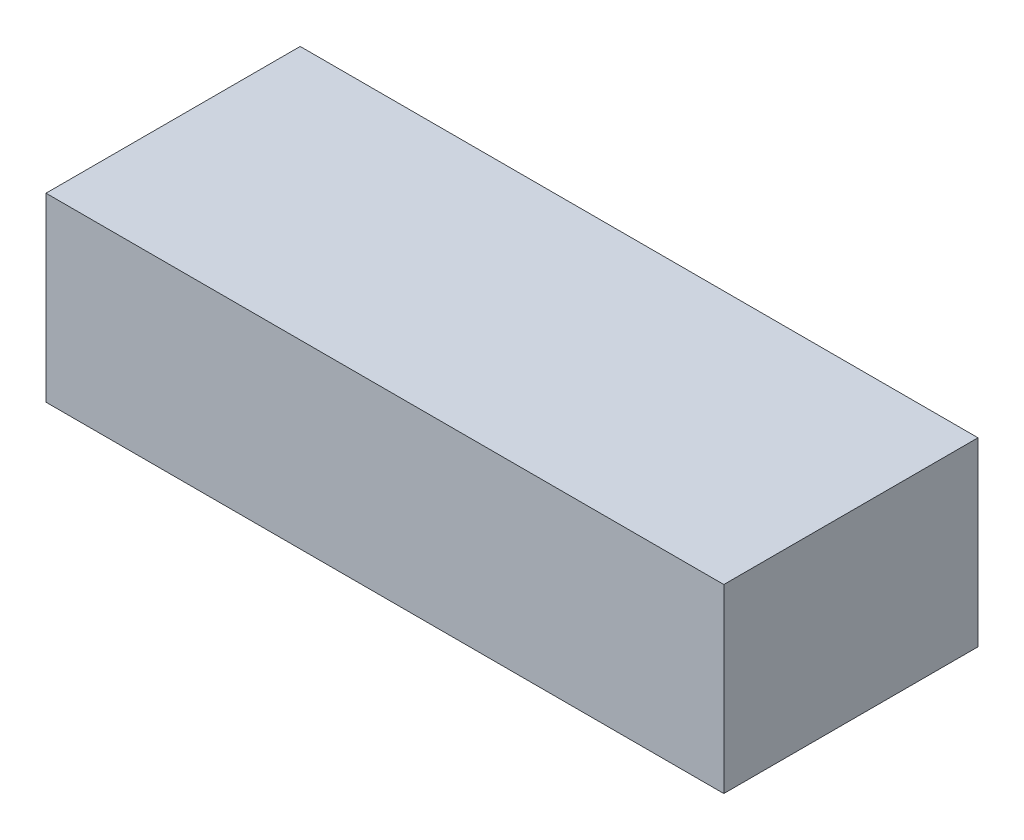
from build123d import *

# Parameters (mm, degrees)
ESQUISSE1_W        = 400
ESQUISSE1_H        = 106.83760684
BOSS_EXTRU_1_DEPTH = 75


with BuildPart() as part:
    # Esquisse1 → Boss.-Extru.1 (new, symmetric)
    with BuildSketch(Plane.XY):
        Rectangle(ESQUISSE1_W, ESQUISSE1_H)
    extrude(amount=BOSS_EXTRU_1_DEPTH, both=True)


solid = part.part
